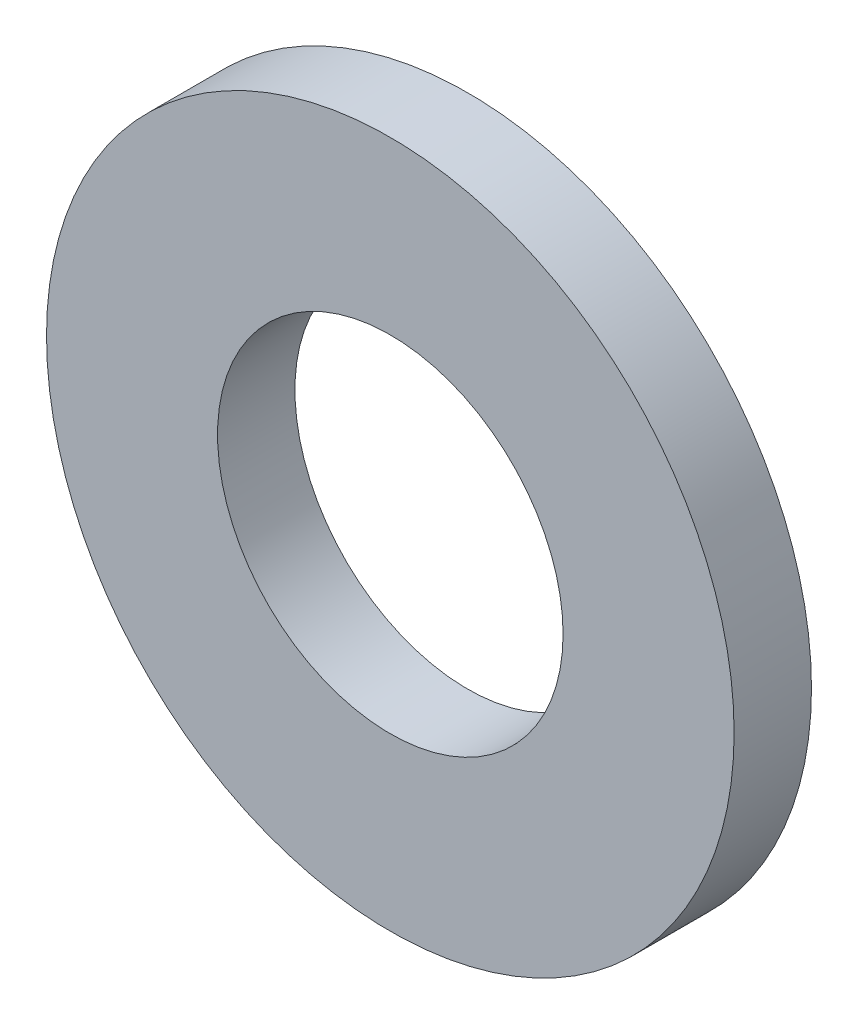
ISO-10303-21;
HEADER;
FILE_DESCRIPTION(('STEP AP214'),'2;1');
FILE_NAME('part.step','',(''),(''),'','','');
FILE_SCHEMA(('AUTOMOTIVE_DESIGN { 1 0 10303 214 1 1 1 1 }'));
ENDSEC;
DATA;
#1=APPLICATION_CONTEXT('core data for automotive mechanical design processes');
#2=APPLICATION_PROTOCOL_DEFINITION('international standard','automotive_design',2000,#1);
#3=PRODUCT_CONTEXT('',#1,'mechanical');
#4=PRODUCT('Part','Part','',(#3));
#5=PRODUCT_RELATED_PRODUCT_CATEGORY('part','',(#4));
#6=PRODUCT_DEFINITION_FORMATION('','',#4);
#7=PRODUCT_DEFINITION_CONTEXT('part definition',#1,'design');
#8=PRODUCT_DEFINITION('design','',#6,#7);
#9=PRODUCT_DEFINITION_SHAPE('','',#8);
#10=(LENGTH_UNIT() NAMED_UNIT(*) SI_UNIT(.MILLI.,.METRE.));
#11=(NAMED_UNIT(*) PLANE_ANGLE_UNIT() SI_UNIT($,.RADIAN.));
#12=(NAMED_UNIT(*) SI_UNIT($,.STERADIAN.) SOLID_ANGLE_UNIT());
#13=UNCERTAINTY_MEASURE_WITH_UNIT(LENGTH_MEASURE(1.E-05),#10,'distance_accuracy_value','');
#14=(GEOMETRIC_REPRESENTATION_CONTEXT(3) GLOBAL_UNCERTAINTY_ASSIGNED_CONTEXT((#13)) GLOBAL_UNIT_ASSIGNED_CONTEXT((#10,
#11,#12)) REPRESENTATION_CONTEXT('',''));
#15=CARTESIAN_POINT('',(0.,0.,0.));
#16=DIRECTION('',(0.,0.,1.));
#17=DIRECTION('',(1.,0.,0.));
#18=AXIS2_PLACEMENT_3D('',#15,#16,#17);
#19=CARTESIAN_POINT('',(0.,0.,4.5));
#20=DIRECTION('',(0.,0.,1.));
#21=DIRECTION('',(1.,0.,0.));
#22=AXIS2_PLACEMENT_3D('',#19,#20,#21);
#23=PLANE('',#22);
#24=CARTESIAN_POINT('',(0.,0.,4.5));
#25=DIRECTION('',(0.,0.,1.));
#26=DIRECTION('',(1.,0.,0.));
#27=AXIS2_PLACEMENT_3D('',#24,#25,#26);
#28=CIRCLE('',#27,20.);
#29=CARTESIAN_POINT('',(20.,0.,4.5));
#30=VERTEX_POINT('',#29);
#31=EDGE_CURVE('E10',#30,#30,#28,.T.);
#32=ORIENTED_EDGE('',*,*,#31,.T.);
#33=EDGE_LOOP('',(#32));
#34=FACE_BOUND('',#33,.T.);
#35=CARTESIAN_POINT('',(0.,0.,4.5));
#36=DIRECTION('',(0.,0.,1.));
#37=DIRECTION('',(1.,0.,0.));
#38=AXIS2_PLACEMENT_3D('',#35,#36,#37);
#39=CIRCLE('',#38,10.05);
#40=CARTESIAN_POINT('',(10.05,0.,4.5));
#41=VERTEX_POINT('',#40);
#42=EDGE_CURVE('E40',#41,#41,#39,.T.);
#43=ORIENTED_EDGE('',*,*,#42,.F.);
#44=EDGE_LOOP('',(#43));
#45=FACE_BOUND('',#44,.T.);
#46=ADVANCED_FACE('F29',(#34,#45),#23,.T.);
#47=CARTESIAN_POINT('',(0.,0.,0.));
#48=DIRECTION('',(0.,0.,1.));
#49=DIRECTION('',(1.,0.,0.));
#50=AXIS2_PLACEMENT_3D('',#47,#48,#49);
#51=PLANE('',#50);
#52=CARTESIAN_POINT('',(0.,0.,0.));
#53=DIRECTION('',(0.,0.,1.));
#54=DIRECTION('',(1.,0.,0.));
#55=AXIS2_PLACEMENT_3D('',#52,#53,#54);
#56=CIRCLE('',#55,20.);
#57=CARTESIAN_POINT('',(20.,0.,0.));
#58=VERTEX_POINT('',#57);
#59=EDGE_CURVE('E36',#58,#58,#56,.T.);
#60=ORIENTED_EDGE('',*,*,#59,.F.);
#61=EDGE_LOOP('',(#60));
#62=FACE_BOUND('',#61,.T.);
#63=CARTESIAN_POINT('',(0.,0.,0.));
#64=DIRECTION('',(0.,0.,1.));
#65=DIRECTION('',(1.,0.,0.));
#66=AXIS2_PLACEMENT_3D('',#63,#64,#65);
#67=CIRCLE('',#66,10.05);
#68=CARTESIAN_POINT('',(10.05,0.,0.));
#69=VERTEX_POINT('',#68);
#70=EDGE_CURVE('E44',#69,#69,#67,.T.);
#71=ORIENTED_EDGE('',*,*,#70,.T.);
#72=EDGE_LOOP('',(#71));
#73=FACE_BOUND('',#72,.T.);
#74=ADVANCED_FACE('F50',(#62,#73),#51,.F.);
#75=CARTESIAN_POINT('',(0.,0.,4.5));
#76=DIRECTION('',(0.,0.,-1.));
#77=DIRECTION('',(-1.,0.,0.));
#78=AXIS2_PLACEMENT_3D('',#75,#76,#77);
#79=CYLINDRICAL_SURFACE('',#78,20.);
#80=ORIENTED_EDGE('',*,*,#31,.F.);
#81=EDGE_LOOP('',(#80));
#82=FACE_BOUND('',#81,.T.);
#83=ORIENTED_EDGE('',*,*,#59,.T.);
#84=EDGE_LOOP('',(#83));
#85=FACE_BOUND('',#84,.T.);
#86=ADVANCED_FACE('F31',(#82,#85),#79,.T.);
#87=CARTESIAN_POINT('',(0.,0.,4.5));
#88=DIRECTION('',(0.,0.,-1.));
#89=DIRECTION('',(-1.,0.,0.));
#90=AXIS2_PLACEMENT_3D('',#87,#88,#89);
#91=CYLINDRICAL_SURFACE('',#90,10.05);
#92=ORIENTED_EDGE('',*,*,#42,.T.);
#93=EDGE_LOOP('',(#92));
#94=FACE_BOUND('',#93,.T.);
#95=ORIENTED_EDGE('',*,*,#70,.F.);
#96=EDGE_LOOP('',(#95));
#97=FACE_BOUND('',#96,.T.);
#98=ADVANCED_FACE('F52',(#94,#97),#91,.F.);
#99=CLOSED_SHELL('',(#46,#74,#86,#98));
#100=MANIFOLD_SOLID_BREP('B2',#99);
#101=ADVANCED_BREP_SHAPE_REPRESENTATION('',(#18,#100),#14);
#102=SHAPE_DEFINITION_REPRESENTATION(#9,#101);
ENDSEC;
END-ISO-10303-21;
